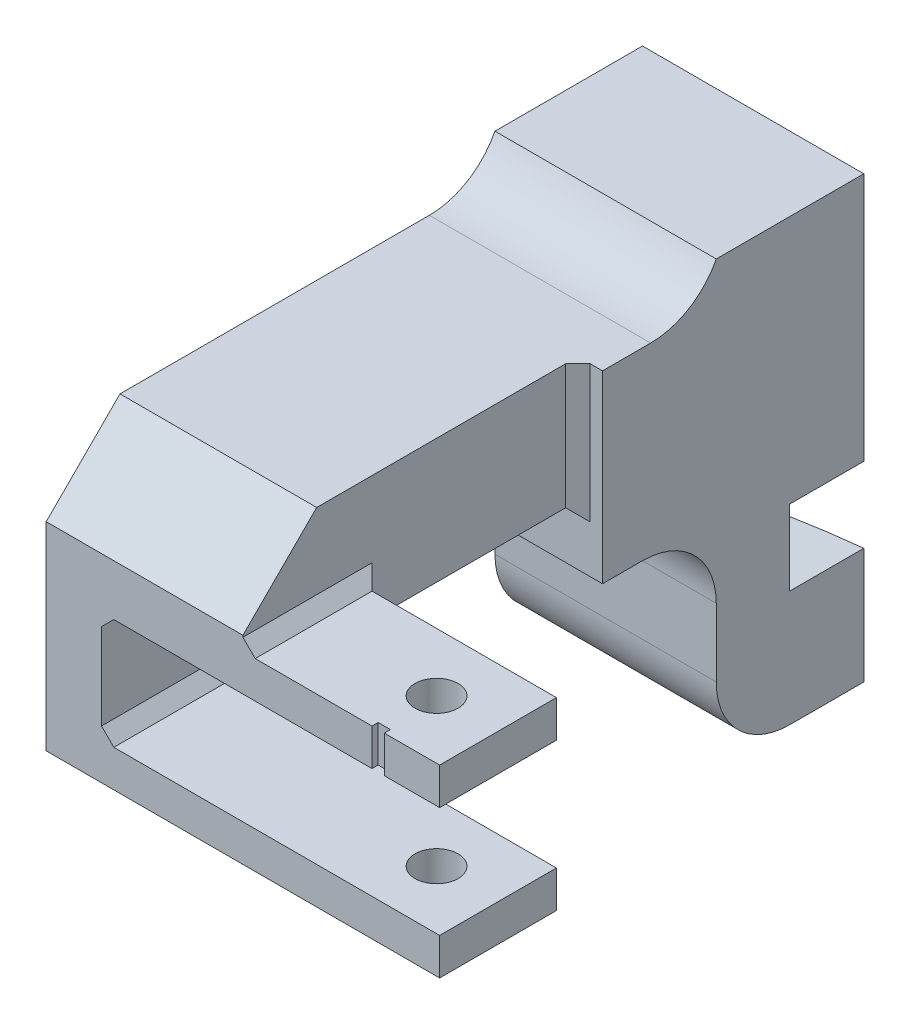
ISO-10303-21;
HEADER;
FILE_DESCRIPTION(('STEP AP214'),'2;1');
FILE_NAME('part.step','',(''),(''),'','','');
FILE_SCHEMA(('AUTOMOTIVE_DESIGN { 1 0 10303 214 1 1 1 1 }'));
ENDSEC;
DATA;
#1=APPLICATION_CONTEXT('core data for automotive mechanical design processes');
#2=APPLICATION_PROTOCOL_DEFINITION('international standard','automotive_design',2000,#1);
#3=PRODUCT_CONTEXT('',#1,'mechanical');
#4=PRODUCT('Part','Part','',(#3));
#5=PRODUCT_RELATED_PRODUCT_CATEGORY('part','',(#4));
#6=PRODUCT_DEFINITION_FORMATION('','',#4);
#7=PRODUCT_DEFINITION_CONTEXT('part definition',#1,'design');
#8=PRODUCT_DEFINITION('design','',#6,#7);
#9=PRODUCT_DEFINITION_SHAPE('','',#8);
#10=(LENGTH_UNIT() NAMED_UNIT(*) SI_UNIT(.MILLI.,.METRE.));
#11=(NAMED_UNIT(*) PLANE_ANGLE_UNIT() SI_UNIT($,.RADIAN.));
#12=(NAMED_UNIT(*) SI_UNIT($,.STERADIAN.) SOLID_ANGLE_UNIT());
#13=UNCERTAINTY_MEASURE_WITH_UNIT(LENGTH_MEASURE(1.E-05),#10,'distance_accuracy_value','');
#14=(GEOMETRIC_REPRESENTATION_CONTEXT(3) GLOBAL_UNCERTAINTY_ASSIGNED_CONTEXT((#13)) GLOBAL_UNIT_ASSIGNED_CONTEXT((#10,
#11,#12)) REPRESENTATION_CONTEXT('',''));
#15=CARTESIAN_POINT('',(0.,0.,0.));
#16=DIRECTION('',(0.,0.,1.));
#17=DIRECTION('',(1.,0.,0.));
#18=AXIS2_PLACEMENT_3D('',#15,#16,#17);
#19=CARTESIAN_POINT('',(0.,0.,48.5));
#20=DIRECTION('',(0.,0.,1.));
#21=DIRECTION('',(1.,0.,0.));
#22=AXIS2_PLACEMENT_3D('',#19,#20,#21);
#23=PLANE('',#22);
#24=DIRECTION('',(0.,-1.,0.));
#25=VECTOR('',#24,1.);
#26=CARTESIAN_POINT('',(17.5,4.5,48.5));
#27=LINE('',#26,#25);
#28=CARTESIAN_POINT('',(17.5,7.5,48.5));
#29=VERTEX_POINT('',#28);
#30=CARTESIAN_POINT('',(17.5,4.5,48.5));
#31=VERTEX_POINT('',#30);
#32=EDGE_CURVE('E688',#29,#31,#27,.T.);
#33=ORIENTED_EDGE('',*,*,#32,.F.);
#34=DIRECTION('',(-1.,0.,0.));
#35=VECTOR('',#34,1.);
#36=CARTESIAN_POINT('',(9.00000000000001,7.5,48.5));
#37=LINE('',#36,#35);
#38=CARTESIAN_POINT('',(8.,7.5,48.5));
#39=VERTEX_POINT('',#38);
#40=EDGE_CURVE('E359',#29,#39,#37,.T.);
#41=ORIENTED_EDGE('',*,*,#40,.T.);
#42=DIRECTION('',(-0.707106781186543,0.707106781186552,0.));
#43=VECTOR('',#42,1.);
#44=CARTESIAN_POINT('',(7.,8.50000000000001,48.5));
#45=LINE('',#44,#43);
#46=CARTESIAN_POINT('',(7.,8.50000000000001,48.5));
#47=VERTEX_POINT('',#46);
#48=EDGE_CURVE('E528',#39,#47,#45,.T.);
#49=ORIENTED_EDGE('',*,*,#48,.T.);
#50=DIRECTION('',(0.,-1.,0.));
#51=VECTOR('',#50,1.);
#52=CARTESIAN_POINT('',(7.,8.64438017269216,48.5));
#53=LINE('',#52,#51);
#54=CARTESIAN_POINT('',(7.,8.64438017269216,48.5));
#55=VERTEX_POINT('',#54);
#56=EDGE_CURVE('E302',#55,#47,#53,.T.);
#57=ORIENTED_EDGE('',*,*,#56,.F.);
#58=DIRECTION('',(-1.,0.,0.));
#59=VECTOR('',#58,1.);
#60=CARTESIAN_POINT('',(0.,8.64438017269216,48.5));
#61=LINE('',#60,#59);
#62=CARTESIAN_POINT('',(-9.00000000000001,8.64438017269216,48.5));
#63=VERTEX_POINT('',#62);
#64=EDGE_CURVE('E478',#55,#63,#61,.T.);
#65=ORIENTED_EDGE('',*,*,#64,.T.);
#66=DIRECTION('',(0.,-1.,0.));
#67=VECTOR('',#66,1.);
#68=CARTESIAN_POINT('',(-9.00000000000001,14.6443801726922,48.5));
#69=LINE('',#68,#67);
#70=CARTESIAN_POINT('',(-8.99999999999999,-7.50000000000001,48.5));
#71=VERTEX_POINT('',#70);
#72=EDGE_CURVE('E365',#63,#71,#69,.T.);
#73=ORIENTED_EDGE('',*,*,#72,.T.);
#74=DIRECTION('',(1.,0.,0.));
#75=VECTOR('',#74,1.);
#76=CARTESIAN_POINT('',(23.,-7.5,48.5));
#77=LINE('',#76,#75);
#78=CARTESIAN_POINT('',(23.,-7.5,48.5));
#79=VERTEX_POINT('',#78);
#80=EDGE_CURVE('E338',#71,#79,#77,.T.);
#81=ORIENTED_EDGE('',*,*,#80,.T.);
#82=DIRECTION('',(0.,1.,0.));
#83=VECTOR('',#82,1.);
#84=CARTESIAN_POINT('',(23.,7.5,48.5));
#85=LINE('',#84,#83);
#86=CARTESIAN_POINT('',(23.,-4.5,48.5));
#87=VERTEX_POINT('',#86);
#88=EDGE_CURVE('E356',#79,#87,#85,.T.);
#89=ORIENTED_EDGE('',*,*,#88,.T.);
#90=DIRECTION('',(1.,0.,0.));
#91=VECTOR('',#90,1.);
#92=CARTESIAN_POINT('',(-4.49999999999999,-4.5,48.5));
#93=LINE('',#92,#91);
#94=CARTESIAN_POINT('',(-3.49999999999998,-4.5,48.5));
#95=VERTEX_POINT('',#94);
#96=EDGE_CURVE('E320',#95,#87,#93,.T.);
#97=ORIENTED_EDGE('',*,*,#96,.F.);
#98=DIRECTION('',(0.707106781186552,-0.707106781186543,0.));
#99=VECTOR('',#98,1.);
#100=CARTESIAN_POINT('',(-3.49999999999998,-4.5,48.5));
#101=LINE('',#100,#99);
#102=CARTESIAN_POINT('',(-4.49999999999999,-3.5,48.5));
#103=VERTEX_POINT('',#102);
#104=EDGE_CURVE('E522',#95,#103,#101,.F.);
#105=ORIENTED_EDGE('',*,*,#104,.T.);
#106=DIRECTION('',(0.,-1.,0.));
#107=VECTOR('',#106,1.);
#108=CARTESIAN_POINT('',(-4.49999999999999,4.5,48.5));
#109=LINE('',#108,#107);
#110=CARTESIAN_POINT('',(-4.49999999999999,3.49999999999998,48.5));
#111=VERTEX_POINT('',#110);
#112=EDGE_CURVE('E322',#111,#103,#109,.T.);
#113=ORIENTED_EDGE('',*,*,#112,.F.);
#114=DIRECTION('',(-0.707106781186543,-0.707106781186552,0.));
#115=VECTOR('',#114,1.);
#116=CARTESIAN_POINT('',(-4.49999999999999,3.49999999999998,48.5));
#117=LINE('',#116,#115);
#118=CARTESIAN_POINT('',(-3.49999999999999,4.5,48.5));
#119=VERTEX_POINT('',#118);
#120=EDGE_CURVE('E530',#111,#119,#117,.F.);
#121=ORIENTED_EDGE('',*,*,#120,.T.);
#122=DIRECTION('',(-1.,0.,0.));
#123=VECTOR('',#122,1.);
#124=CARTESIAN_POINT('',(23.,4.5,48.5));
#125=LINE('',#124,#123);
#126=EDGE_CURVE('E325',#31,#119,#125,.T.);
#127=ORIENTED_EDGE('',*,*,#126,.F.);
#128=EDGE_LOOP('',(#33,#41,#49,#57,#65,#73,#81,#89,#97,#105,#113,#121,#127));
#129=FACE_BOUND('',#128,.T.);
#130=ADVANCED_FACE('F33',(#129),#23,.T.);
#131=CARTESIAN_POINT('',(0.,0.,39.));
#132=DIRECTION('',(0.,0.,-1.));
#133=DIRECTION('',(-1.,0.,0.));
#134=AXIS2_PLACEMENT_3D('',#131,#132,#133);
#135=PLANE('',#134);
#136=DIRECTION('',(0.,-1.,0.));
#137=VECTOR('',#136,1.);
#138=CARTESIAN_POINT('',(-8.99999999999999,-7.50000000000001,39.));
#139=LINE('',#138,#137);
#140=CARTESIAN_POINT('',(-9.,-1.35561982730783,39.));
#141=VERTEX_POINT('',#140);
#142=CARTESIAN_POINT('',(-8.99999999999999,-7.50000000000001,39.));
#143=VERTEX_POINT('',#142);
#144=EDGE_CURVE('E339',#141,#143,#139,.T.);
#145=ORIENTED_EDGE('',*,*,#144,.F.);
#146=DIRECTION('',(1.,0.,0.));
#147=VECTOR('',#146,1.);
#148=CARTESIAN_POINT('',(0.,-1.35561982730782,39.));
#149=LINE('',#148,#147);
#150=CARTESIAN_POINT('',(-4.49999999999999,-1.35561982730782,39.));
#151=VERTEX_POINT('',#150);
#152=EDGE_CURVE('E485',#141,#151,#149,.T.);
#153=ORIENTED_EDGE('',*,*,#152,.T.);
#154=DIRECTION('',(0.,1.,0.));
#155=VECTOR('',#154,1.);
#156=CARTESIAN_POINT('',(-4.49999999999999,0.,39.));
#157=LINE('',#156,#155);
#158=CARTESIAN_POINT('',(-4.49999999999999,-3.5,39.));
#159=VERTEX_POINT('',#158);
#160=EDGE_CURVE('E441',#159,#151,#157,.T.);
#161=ORIENTED_EDGE('',*,*,#160,.F.);
#162=DIRECTION('',(-0.707106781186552,0.707106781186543,0.));
#163=VECTOR('',#162,1.);
#164=CARTESIAN_POINT('',(-3.49999999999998,-4.5,39.));
#165=LINE('',#164,#163);
#166=CARTESIAN_POINT('',(-3.49999999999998,-4.5,39.));
#167=VERTEX_POINT('',#166);
#168=EDGE_CURVE('E524',#159,#167,#165,.F.);
#169=ORIENTED_EDGE('',*,*,#168,.T.);
#170=DIRECTION('',(-1.,0.,0.));
#171=VECTOR('',#170,1.);
#172=CARTESIAN_POINT('',(0.,-4.5,39.));
#173=LINE('',#172,#171);
#174=CARTESIAN_POINT('',(23.,-4.5,39.));
#175=VERTEX_POINT('',#174);
#176=EDGE_CURVE('E329',#175,#167,#173,.T.);
#177=ORIENTED_EDGE('',*,*,#176,.F.);
#178=DIRECTION('',(0.,1.,0.));
#179=VECTOR('',#178,1.);
#180=CARTESIAN_POINT('',(23.,7.5,39.));
#181=LINE('',#180,#179);
#182=CARTESIAN_POINT('',(23.,-7.5,39.));
#183=VERTEX_POINT('',#182);
#184=EDGE_CURVE('E346',#183,#175,#181,.T.);
#185=ORIENTED_EDGE('',*,*,#184,.F.);
#186=DIRECTION('',(1.,0.,0.));
#187=VECTOR('',#186,1.);
#188=CARTESIAN_POINT('',(23.,-7.5,39.));
#189=LINE('',#188,#187);
#190=EDGE_CURVE('E341',#143,#183,#189,.T.);
#191=ORIENTED_EDGE('',*,*,#190,.F.);
#192=EDGE_LOOP('',(#145,#153,#161,#169,#177,#185,#191));
#193=FACE_BOUND('',#192,.T.);
#194=ADVANCED_FACE('F663',(#193),#135,.T.);
#195=CARTESIAN_POINT('',(23.,7.5,39.));
#196=DIRECTION('',(1.,0.,0.));
#197=DIRECTION('',(0.,1.,0.));
#198=AXIS2_PLACEMENT_3D('',#195,#196,#197);
#199=PLANE('',#198);
#200=DIRECTION('',(0.,0.,-1.));
#201=VECTOR('',#200,1.);
#202=CARTESIAN_POINT('',(23.,-4.5,39.));
#203=LINE('',#202,#201);
#204=EDGE_CURVE('E439',#87,#175,#203,.T.);
#205=ORIENTED_EDGE('',*,*,#204,.F.);
#206=ORIENTED_EDGE('',*,*,#88,.F.);
#207=DIRECTION('',(0.,0.,1.));
#208=VECTOR('',#207,1.);
#209=CARTESIAN_POINT('',(23.,-7.5,39.));
#210=LINE('',#209,#208);
#211=EDGE_CURVE('E366',#183,#79,#210,.T.);
#212=ORIENTED_EDGE('',*,*,#211,.F.);
#213=ORIENTED_EDGE('',*,*,#184,.T.);
#214=EDGE_LOOP('',(#205,#206,#212,#213));
#215=FACE_BOUND('',#214,.T.);
#216=ADVANCED_FACE('F671',(#215),#199,.T.);
#217=CARTESIAN_POINT('',(0.,0.,0.));
#218=DIRECTION('',(0.,0.,1.));
#219=DIRECTION('',(1.,0.,0.));
#220=AXIS2_PLACEMENT_3D('',#217,#218,#219);
#221=PLANE('',#220);
#222=CARTESIAN_POINT('',(18.,-102.,0.));
#223=DIRECTION('',(0.,0.,-1.));
#224=DIRECTION('',(-1.,0.,0.));
#225=AXIS2_PLACEMENT_3D('',#222,#223,#224);
#226=CIRCLE('',#225,93.9500000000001);
#227=CARTESIAN_POINT('',(-8.99999999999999,-12.013320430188,0.));
#228=VERTEX_POINT('',#227);
#229=CARTESIAN_POINT('',(9.00000000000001,-8.48207391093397,0.));
#230=VERTEX_POINT('',#229);
#231=EDGE_CURVE('E380',#228,#230,#226,.T.);
#232=ORIENTED_EDGE('',*,*,#231,.T.);
#233=DIRECTION('',(0.,1.,0.));
#234=VECTOR('',#233,1.);
#235=CARTESIAN_POINT('',(9.,17.9,0.));
#236=LINE('',#235,#234);
#237=CARTESIAN_POINT('',(9.00000000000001,-17.9,0.));
#238=VERTEX_POINT('',#237);
#239=EDGE_CURVE('E422',#238,#230,#236,.T.);
#240=ORIENTED_EDGE('',*,*,#239,.F.);
#241=DIRECTION('',(1.,0.,0.));
#242=VECTOR('',#241,1.);
#243=CARTESIAN_POINT('',(-8.99999999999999,-17.9,0.));
#244=LINE('',#243,#242);
#245=CARTESIAN_POINT('',(-8.99999999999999,-17.9,0.));
#246=VERTEX_POINT('',#245);
#247=EDGE_CURVE('E418',#246,#238,#244,.T.);
#248=ORIENTED_EDGE('',*,*,#247,.F.);
#249=DIRECTION('',(0.,-1.,0.));
#250=VECTOR('',#249,1.);
#251=CARTESIAN_POINT('',(-9.,17.9,0.));
#252=LINE('',#251,#250);
#253=EDGE_CURVE('E403',#228,#246,#252,.T.);
#254=ORIENTED_EDGE('',*,*,#253,.F.);
#255=EDGE_LOOP('',(#232,#240,#248,#254));
#256=FACE_BOUND('',#255,.T.);
#257=ADVANCED_FACE('F638',(#256),#221,.F.);
#258=CARTESIAN_POINT('',(-9.,17.9,12.));
#259=DIRECTION('',(1.,0.,0.));
#260=DIRECTION('',(0.,1.,0.));
#261=AXIS2_PLACEMENT_3D('',#258,#259,#260);
#262=PLANE('',#261);
#263=ORIENTED_EDGE('',*,*,#72,.F.);
#264=DIRECTION('',(0.,-0.707106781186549,0.707106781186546));
#265=VECTOR('',#264,1.);
#266=CARTESIAN_POINT('',(-9.,14.6443801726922,42.5));
#267=LINE('',#266,#265);
#268=CARTESIAN_POINT('',(-9.00000000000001,14.6443801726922,42.5));
#269=VERTEX_POINT('',#268);
#270=EDGE_CURVE('E480',#63,#269,#267,.F.);
#271=ORIENTED_EDGE('',*,*,#270,.T.);
#272=DIRECTION('',(0.,0.,-1.));
#273=VECTOR('',#272,1.);
#274=CARTESIAN_POINT('',(-9.00000000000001,14.6443801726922,48.5));
#275=LINE('',#274,#273);
#276=CARTESIAN_POINT('',(-9.00000000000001,14.6443801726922,17.3355765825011));
#277=VERTEX_POINT('',#276);
#278=EDGE_CURVE('E371',#269,#277,#275,.T.);
#279=ORIENTED_EDGE('',*,*,#278,.T.);
#280=CARTESIAN_POINT('',(-9.,20.6443801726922,17.3355765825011));
#281=DIRECTION('',(1.,0.,0.));
#282=DIRECTION('',(0.,1.,0.));
#283=AXIS2_PLACEMENT_3D('',#280,#281,#282);
#284=CIRCLE('',#283,6.);
#285=CARTESIAN_POINT('',(-9.,17.9,12.));
#286=VERTEX_POINT('',#285);
#287=EDGE_CURVE('E468',#277,#286,#284,.T.);
#288=ORIENTED_EDGE('',*,*,#287,.T.);
#289=DIRECTION('',(0.,0.,-1.));
#290=VECTOR('',#289,1.);
#291=CARTESIAN_POINT('',(-9.,17.9,12.));
#292=LINE('',#291,#290);
#293=CARTESIAN_POINT('',(-9.,17.9,0.));
#294=VERTEX_POINT('',#293);
#295=EDGE_CURVE('E414',#286,#294,#292,.T.);
#296=ORIENTED_EDGE('',*,*,#295,.T.);
#297=CARTESIAN_POINT('',(-8.99999999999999,-5.66204019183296,0.));
#298=VERTEX_POINT('',#297);
#299=EDGE_CURVE('E415',#294,#298,#252,.T.);
#300=ORIENTED_EDGE('',*,*,#299,.T.);
#301=DIRECTION('',(0.,0.,-1.));
#302=VECTOR('',#301,1.);
#303=CARTESIAN_POINT('',(-9.,-5.66204019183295,6.05));
#304=LINE('',#303,#302);
#305=CARTESIAN_POINT('',(-9.,-5.66204019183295,6.05));
#306=VERTEX_POINT('',#305);
#307=EDGE_CURVE('E398',#298,#306,#304,.F.);
#308=ORIENTED_EDGE('',*,*,#307,.T.);
#309=DIRECTION('',(0.,1.,0.));
#310=VECTOR('',#309,1.);
#311=CARTESIAN_POINT('',(-9.,17.9,6.05));
#312=LINE('',#311,#310);
#313=CARTESIAN_POINT('',(-9.,-12.013320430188,6.05));
#314=VERTEX_POINT('',#313);
#315=EDGE_CURVE('E401',#314,#306,#312,.T.);
#316=ORIENTED_EDGE('',*,*,#315,.F.);
#317=DIRECTION('',(0.,0.,-1.));
#318=VECTOR('',#317,1.);
#319=CARTESIAN_POINT('',(-9.,-12.013320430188,6.05));
#320=LINE('',#319,#318);
#321=EDGE_CURVE('E393',#228,#314,#320,.F.);
#322=ORIENTED_EDGE('',*,*,#321,.F.);
#323=ORIENTED_EDGE('',*,*,#253,.T.);
#324=DIRECTION('',(0.,0.,-1.));
#325=VECTOR('',#324,1.);
#326=CARTESIAN_POINT('',(-8.99999999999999,-17.9,12.));
#327=LINE('',#326,#325);
#328=CARTESIAN_POINT('',(-8.99999999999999,-17.9,6.));
#329=VERTEX_POINT('',#328);
#330=EDGE_CURVE('E433',#329,#246,#327,.T.);
#331=ORIENTED_EDGE('',*,*,#330,.F.);
#332=CARTESIAN_POINT('',(-8.99999999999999,-11.9,6.));
#333=DIRECTION('',(1.,0.,0.));
#334=DIRECTION('',(0.,1.,0.));
#335=AXIS2_PLACEMENT_3D('',#332,#333,#334);
#336=CIRCLE('',#335,6.);
#337=CARTESIAN_POINT('',(-8.99999999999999,-11.9,12.));
#338=VERTEX_POINT('',#337);
#339=EDGE_CURVE('E463',#329,#338,#336,.F.);
#340=ORIENTED_EDGE('',*,*,#339,.T.);
#341=DIRECTION('',(0.,-1.,0.));
#342=VECTOR('',#341,1.);
#343=CARTESIAN_POINT('',(-9.,17.9,12.));
#344=LINE('',#343,#342);
#345=CARTESIAN_POINT('',(-8.99999999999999,-6.35561982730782,12.));
#346=VERTEX_POINT('',#345);
#347=EDGE_CURVE('E404',#346,#338,#344,.T.);
#348=ORIENTED_EDGE('',*,*,#347,.F.);
#349=CARTESIAN_POINT('',(-8.99999999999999,-6.35561982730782,18.));
#350=DIRECTION('',(1.,0.,0.));
#351=DIRECTION('',(0.,1.,0.));
#352=AXIS2_PLACEMENT_3D('',#349,#350,#351);
#353=CIRCLE('',#352,6.);
#354=CARTESIAN_POINT('',(-9.00000000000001,-0.355619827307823,18.));
#355=VERTEX_POINT('',#354);
#356=EDGE_CURVE('E472',#346,#355,#353,.T.);
#357=ORIENTED_EDGE('',*,*,#356,.T.);
#358=DIRECTION('',(0.,0.,-1.));
#359=VECTOR('',#358,1.);
#360=CARTESIAN_POINT('',(-9.00000000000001,-0.355619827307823,48.5));
#361=LINE('',#360,#359);
#362=CARTESIAN_POINT('',(-9.00000000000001,-0.355619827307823,38.));
#363=VERTEX_POINT('',#362);
#364=EDGE_CURVE('E378',#363,#355,#361,.T.);
#365=ORIENTED_EDGE('',*,*,#364,.F.);
#366=DIRECTION('',(0.,-0.70710678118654,0.707106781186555));
#367=VECTOR('',#366,1.);
#368=CARTESIAN_POINT('',(-9.,21.7721900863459,15.8721900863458));
#369=LINE('',#368,#367);
#370=EDGE_CURVE('E518',#363,#141,#369,.T.);
#371=ORIENTED_EDGE('',*,*,#370,.T.);
#372=ORIENTED_EDGE('',*,*,#144,.T.);
#373=DIRECTION('',(0.,0.,1.));
#374=VECTOR('',#373,1.);
#375=CARTESIAN_POINT('',(-8.99999999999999,-7.50000000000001,39.));
#376=LINE('',#375,#374);
#377=EDGE_CURVE('E352',#143,#71,#376,.T.);
#378=ORIENTED_EDGE('',*,*,#377,.T.);
#379=EDGE_LOOP('',(#263,#271,#279,#288,#296,#300,#308,#316,#322,#323,#331,#340,#348,#357,#365,
#371,#372,#378));
#380=FACE_BOUND('',#379,.T.);
#381=ADVANCED_FACE('F614',(#380),#262,.F.);
#382=CARTESIAN_POINT('',(-8.99999999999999,-17.9,12.));
#383=DIRECTION('',(0.,1.,0.));
#384=DIRECTION('',(-1.,0.,0.));
#385=AXIS2_PLACEMENT_3D('',#382,#383,#384);
#386=PLANE('',#385);
#387=DIRECTION('',(0.,0.,-1.));
#388=VECTOR('',#387,1.);
#389=CARTESIAN_POINT('',(9.00000000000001,-17.9,12.));
#390=LINE('',#389,#388);
#391=CARTESIAN_POINT('',(9.00000000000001,-17.9,6.));
#392=VERTEX_POINT('',#391);
#393=EDGE_CURVE('E431',#392,#238,#390,.T.);
#394=ORIENTED_EDGE('',*,*,#393,.F.);
#395=DIRECTION('',(1.,0.,0.));
#396=VECTOR('',#395,1.);
#397=CARTESIAN_POINT('',(-8.99999999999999,-17.9,6.));
#398=LINE('',#397,#396);
#399=EDGE_CURVE('E461',#392,#329,#398,.F.);
#400=ORIENTED_EDGE('',*,*,#399,.T.);
#401=ORIENTED_EDGE('',*,*,#330,.T.);
#402=ORIENTED_EDGE('',*,*,#247,.T.);
#403=EDGE_LOOP('',(#394,#400,#401,#402));
#404=FACE_BOUND('',#403,.T.);
#405=ADVANCED_FACE('F653',(#404),#386,.F.);
#406=CARTESIAN_POINT('',(9.,17.9,12.));
#407=DIRECTION('',(-1.,0.,0.));
#408=DIRECTION('',(0.,-1.,0.));
#409=AXIS2_PLACEMENT_3D('',#406,#407,#408);
#410=PLANE('',#409);
#411=DIRECTION('',(0.,0.,-1.));
#412=VECTOR('',#411,1.);
#413=CARTESIAN_POINT('',(9.00000000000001,14.6443801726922,48.5));
#414=LINE('',#413,#412);
#415=CARTESIAN_POINT('',(9.,14.6443801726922,21.25));
#416=VERTEX_POINT('',#415);
#417=CARTESIAN_POINT('',(9.00000000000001,14.6443801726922,17.3355765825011));
#418=VERTEX_POINT('',#417);
#419=EDGE_CURVE('E373',#416,#418,#414,.T.);
#420=ORIENTED_EDGE('',*,*,#419,.F.);
#421=DIRECTION('',(0.,1.,0.));
#422=VECTOR('',#421,1.);
#423=CARTESIAN_POINT('',(9.,17.9,21.25));
#424=LINE('',#423,#422);
#425=CARTESIAN_POINT('',(9.,-0.355619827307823,21.25));
#426=VERTEX_POINT('',#425);
#427=EDGE_CURVE('E335',#426,#416,#424,.T.);
#428=ORIENTED_EDGE('',*,*,#427,.F.);
#429=DIRECTION('',(0.,0.,-1.));
#430=VECTOR('',#429,1.);
#431=CARTESIAN_POINT('',(9.00000000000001,-0.355619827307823,48.5));
#432=LINE('',#431,#430);
#433=CARTESIAN_POINT('',(9.00000000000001,-0.355619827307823,18.));
#434=VERTEX_POINT('',#433);
#435=EDGE_CURVE('E375',#426,#434,#432,.T.);
#436=ORIENTED_EDGE('',*,*,#435,.T.);
#437=CARTESIAN_POINT('',(9.,-6.35561982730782,18.));
#438=DIRECTION('',(-1.,0.,0.));
#439=DIRECTION('',(0.,-1.,0.));
#440=AXIS2_PLACEMENT_3D('',#437,#438,#439);
#441=CIRCLE('',#440,6.);
#442=CARTESIAN_POINT('',(9.00000000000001,-6.35561982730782,12.));
#443=VERTEX_POINT('',#442);
#444=EDGE_CURVE('E470',#434,#443,#441,.T.);
#445=ORIENTED_EDGE('',*,*,#444,.T.);
#446=DIRECTION('',(0.,1.,0.));
#447=VECTOR('',#446,1.);
#448=CARTESIAN_POINT('',(9.,17.9,12.));
#449=LINE('',#448,#447);
#450=CARTESIAN_POINT('',(9.00000000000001,-11.9,12.));
#451=VERTEX_POINT('',#450);
#452=EDGE_CURVE('E407',#451,#443,#449,.T.);
#453=ORIENTED_EDGE('',*,*,#452,.F.);
#454=CARTESIAN_POINT('',(9.00000000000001,-11.9,6.));
#455=DIRECTION('',(-1.,0.,0.));
#456=DIRECTION('',(0.,-1.,0.));
#457=AXIS2_PLACEMENT_3D('',#454,#455,#456);
#458=CIRCLE('',#457,6.);
#459=EDGE_CURVE('E459',#451,#392,#458,.F.);
#460=ORIENTED_EDGE('',*,*,#459,.T.);
#461=ORIENTED_EDGE('',*,*,#393,.T.);
#462=ORIENTED_EDGE('',*,*,#239,.T.);
#463=DIRECTION('',(0.,0.,-1.));
#464=VECTOR('',#463,1.);
#465=CARTESIAN_POINT('',(9.00000000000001,-8.48207391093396,6.05));
#466=LINE('',#465,#464);
#467=CARTESIAN_POINT('',(9.00000000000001,-8.48207391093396,6.05));
#468=VERTEX_POINT('',#467);
#469=EDGE_CURVE('E390',#468,#230,#466,.T.);
#470=ORIENTED_EDGE('',*,*,#469,.F.);
#471=DIRECTION('',(0.,-1.,0.));
#472=VECTOR('',#471,1.);
#473=CARTESIAN_POINT('',(9.,17.9,6.05));
#474=LINE('',#473,#472);
#475=CARTESIAN_POINT('',(9.,-2.35561982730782,6.05));
#476=VERTEX_POINT('',#475);
#477=EDGE_CURVE('E435',#476,#468,#474,.T.);
#478=ORIENTED_EDGE('',*,*,#477,.F.);
#479=DIRECTION('',(0.,0.,-1.));
#480=VECTOR('',#479,1.);
#481=CARTESIAN_POINT('',(9.,-2.35561982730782,6.05));
#482=LINE('',#481,#480);
#483=CARTESIAN_POINT('',(9.00000000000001,-2.35561982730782,0.));
#484=VERTEX_POINT('',#483);
#485=EDGE_CURVE('E395',#476,#484,#482,.T.);
#486=ORIENTED_EDGE('',*,*,#485,.T.);
#487=CARTESIAN_POINT('',(9.,17.9,0.));
#488=VERTEX_POINT('',#487);
#489=EDGE_CURVE('E421',#484,#488,#236,.T.);
#490=ORIENTED_EDGE('',*,*,#489,.T.);
#491=DIRECTION('',(0.,0.,-1.));
#492=VECTOR('',#491,1.);
#493=CARTESIAN_POINT('',(9.,17.9,12.));
#494=LINE('',#493,#492);
#495=CARTESIAN_POINT('',(9.,17.9,12.));
#496=VERTEX_POINT('',#495);
#497=EDGE_CURVE('E428',#496,#488,#494,.T.);
#498=ORIENTED_EDGE('',*,*,#497,.F.);
#499=CARTESIAN_POINT('',(9.,20.6443801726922,17.3355765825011));
#500=DIRECTION('',(-1.,0.,0.));
#501=DIRECTION('',(0.,-1.,0.));
#502=AXIS2_PLACEMENT_3D('',#499,#500,#501);
#503=CIRCLE('',#502,6.);
#504=EDGE_CURVE('E465',#496,#418,#503,.T.);
#505=ORIENTED_EDGE('',*,*,#504,.T.);
#506=EDGE_LOOP('',(#420,#428,#436,#445,#453,#460,#461,#462,#470,#478,#486,#490,#498,#505));
#507=FACE_BOUND('',#506,.T.);
#508=ADVANCED_FACE('F604',(#507),#410,.F.);
#509=CARTESIAN_POINT('',(-9.,17.9,12.));
#510=DIRECTION('',(0.,-1.,0.));
#511=DIRECTION('',(1.,0.,0.));
#512=AXIS2_PLACEMENT_3D('',#509,#510,#511);
#513=PLANE('',#512);
#514=DIRECTION('',(-1.,0.,0.));
#515=VECTOR('',#514,1.);
#516=CARTESIAN_POINT('',(-9.,17.9,0.));
#517=LINE('',#516,#515);
#518=EDGE_CURVE('E408',#488,#294,#517,.T.);
#519=ORIENTED_EDGE('',*,*,#518,.T.);
#520=ORIENTED_EDGE('',*,*,#295,.F.);
#521=DIRECTION('',(-1.,0.,0.));
#522=VECTOR('',#521,1.);
#523=CARTESIAN_POINT('',(-9.,17.9,12.));
#524=LINE('',#523,#522);
#525=EDGE_CURVE('E411',#496,#286,#524,.T.);
#526=ORIENTED_EDGE('',*,*,#525,.F.);
#527=ORIENTED_EDGE('',*,*,#497,.T.);
#528=EDGE_LOOP('',(#519,#520,#526,#527));
#529=FACE_BOUND('',#528,.T.);
#530=ADVANCED_FACE('F617',(#529),#513,.F.);
#531=CARTESIAN_POINT('',(0.,0.,12.));
#532=DIRECTION('',(0.,0.,1.));
#533=DIRECTION('',(1.,0.,0.));
#534=AXIS2_PLACEMENT_3D('',#531,#532,#533);
#535=PLANE('',#534);
#536=ORIENTED_EDGE('',*,*,#452,.T.);
#537=DIRECTION('',(1.,0.,0.));
#538=VECTOR('',#537,1.);
#539=CARTESIAN_POINT('',(0.,-6.35561982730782,12.));
#540=LINE('',#539,#538);
#541=EDGE_CURVE('E457',#443,#346,#540,.F.);
#542=ORIENTED_EDGE('',*,*,#541,.T.);
#543=ORIENTED_EDGE('',*,*,#347,.T.);
#544=DIRECTION('',(1.,0.,0.));
#545=VECTOR('',#544,1.);
#546=CARTESIAN_POINT('',(9.00000000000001,-11.9,12.));
#547=LINE('',#546,#545);
#548=EDGE_CURVE('E454',#338,#451,#547,.T.);
#549=ORIENTED_EDGE('',*,*,#548,.T.);
#550=EDGE_LOOP('',(#536,#542,#543,#549));
#551=FACE_BOUND('',#550,.T.);
#552=ADVANCED_FACE('F650',(#551),#535,.T.);
#553=ORIENTED_EDGE('',*,*,#489,.F.);
#554=CARTESIAN_POINT('',(18.,-102.,0.));
#555=DIRECTION('',(0.,0.,-1.));
#556=DIRECTION('',(-1.,0.,0.));
#557=AXIS2_PLACEMENT_3D('',#554,#555,#556);
#558=CIRCLE('',#557,100.05);
#559=EDGE_CURVE('E384',#298,#484,#558,.T.);
#560=ORIENTED_EDGE('',*,*,#559,.F.);
#561=ORIENTED_EDGE('',*,*,#299,.F.);
#562=ORIENTED_EDGE('',*,*,#518,.F.);
#563=EDGE_LOOP('',(#553,#560,#561,#562));
#564=FACE_BOUND('',#563,.T.);
#565=ADVANCED_FACE('F621',(#564),#221,.F.);
#566=CARTESIAN_POINT('',(18.,-102.,6.05));
#567=DIRECTION('',(0.,0.,-1.));
#568=DIRECTION('',(-1.,0.,0.));
#569=AXIS2_PLACEMENT_3D('',#566,#567,#568);
#570=PLANE('',#569);
#571=ORIENTED_EDGE('',*,*,#315,.T.);
#572=CARTESIAN_POINT('',(18.,-102.,6.05));
#573=DIRECTION('',(0.,0.,-1.));
#574=DIRECTION('',(-1.,0.,0.));
#575=AXIS2_PLACEMENT_3D('',#572,#573,#574);
#576=CIRCLE('',#575,100.05);
#577=EDGE_CURVE('E387',#306,#476,#576,.T.);
#578=ORIENTED_EDGE('',*,*,#577,.T.);
#579=ORIENTED_EDGE('',*,*,#477,.T.);
#580=CARTESIAN_POINT('',(18.,-102.,6.05));
#581=DIRECTION('',(0.,0.,-1.));
#582=DIRECTION('',(-1.,0.,0.));
#583=AXIS2_PLACEMENT_3D('',#580,#581,#582);
#584=CIRCLE('',#583,93.9500000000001);
#585=EDGE_CURVE('E381',#314,#468,#584,.T.);
#586=ORIENTED_EDGE('',*,*,#585,.F.);
#587=EDGE_LOOP('',(#571,#578,#579,#586));
#588=FACE_BOUND('',#587,.T.);
#589=ADVANCED_FACE('F630',(#588),#570,.T.);
#590=CARTESIAN_POINT('',(18.,-102.,6.05));
#591=DIRECTION('',(0.,0.,-1.));
#592=DIRECTION('',(-1.,0.,0.));
#593=AXIS2_PLACEMENT_3D('',#590,#591,#592);
#594=CYLINDRICAL_SURFACE('',#593,100.05);
#595=ORIENTED_EDGE('',*,*,#559,.T.);
#596=ORIENTED_EDGE('',*,*,#485,.F.);
#597=ORIENTED_EDGE('',*,*,#577,.F.);
#598=ORIENTED_EDGE('',*,*,#307,.F.);
#599=EDGE_LOOP('',(#595,#596,#597,#598));
#600=FACE_BOUND('',#599,.T.);
#601=ADVANCED_FACE('F627',(#600),#594,.F.);
#602=CARTESIAN_POINT('',(18.,-102.,6.05));
#603=DIRECTION('',(0.,0.,-1.));
#604=DIRECTION('',(-1.,0.,0.));
#605=AXIS2_PLACEMENT_3D('',#602,#603,#604);
#606=CYLINDRICAL_SURFACE('',#605,93.9500000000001);
#607=ORIENTED_EDGE('',*,*,#321,.T.);
#608=ORIENTED_EDGE('',*,*,#585,.T.);
#609=ORIENTED_EDGE('',*,*,#469,.T.);
#610=ORIENTED_EDGE('',*,*,#231,.F.);
#611=EDGE_LOOP('',(#607,#608,#609,#610));
#612=FACE_BOUND('',#611,.T.);
#613=ADVANCED_FACE('F635',(#612),#606,.T.);
#614=CARTESIAN_POINT('',(-9.00000000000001,-0.355619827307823,48.5));
#615=DIRECTION('',(0.,1.,0.));
#616=DIRECTION('',(0.,0.,1.));
#617=AXIS2_PLACEMENT_3D('',#614,#615,#616);
#618=PLANE('',#617);
#619=DIRECTION('',(0.,0.,1.));
#620=VECTOR('',#619,1.);
#621=CARTESIAN_POINT('',(-4.49999999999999,-0.355619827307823,48.5));
#622=LINE('',#621,#620);
#623=CARTESIAN_POINT('',(-4.49999999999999,-0.355619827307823,22.25));
#624=VERTEX_POINT('',#623);
#625=CARTESIAN_POINT('',(-4.49999999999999,-0.355619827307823,38.));
#626=VERTEX_POINT('',#625);
#627=EDGE_CURVE('E332',#624,#626,#622,.T.);
#628=ORIENTED_EDGE('',*,*,#627,.T.);
#629=DIRECTION('',(-1.,0.,0.));
#630=VECTOR('',#629,1.);
#631=CARTESIAN_POINT('',(-9.00000000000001,-0.355619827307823,38.));
#632=LINE('',#631,#630);
#633=EDGE_CURVE('E482',#626,#363,#632,.T.);
#634=ORIENTED_EDGE('',*,*,#633,.T.);
#635=ORIENTED_EDGE('',*,*,#364,.T.);
#636=DIRECTION('',(1.,0.,0.));
#637=VECTOR('',#636,1.);
#638=CARTESIAN_POINT('',(-9.00000000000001,-0.355619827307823,18.));
#639=LINE('',#638,#637);
#640=EDGE_CURVE('E451',#355,#434,#639,.T.);
#641=ORIENTED_EDGE('',*,*,#640,.T.);
#642=ORIENTED_EDGE('',*,*,#435,.F.);
#643=DIRECTION('',(1.,0.,0.));
#644=VECTOR('',#643,1.);
#645=CARTESIAN_POINT('',(-9.00000000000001,-0.355619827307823,21.25));
#646=LINE('',#645,#644);
#647=CARTESIAN_POINT('',(-3.49999999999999,-0.355619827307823,21.25));
#648=VERTEX_POINT('',#647);
#649=EDGE_CURVE('E444',#648,#426,#646,.T.);
#650=ORIENTED_EDGE('',*,*,#649,.F.);
#651=DIRECTION('',(-0.707106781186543,0.,0.707106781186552));
#652=VECTOR('',#651,1.);
#653=CARTESIAN_POINT('',(-19.875,-0.355619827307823,37.6250000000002));
#654=LINE('',#653,#652);
#655=EDGE_CURVE('E42',#648,#624,#654,.T.);
#656=ORIENTED_EDGE('',*,*,#655,.T.);
#657=EDGE_LOOP('',(#628,#634,#635,#641,#642,#650,#656));
#658=FACE_BOUND('',#657,.T.);
#659=ADVANCED_FACE('F599',(#658),#618,.F.);
#660=CARTESIAN_POINT('',(-9.00000000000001,14.6443801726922,48.5));
#661=DIRECTION('',(0.,1.,0.));
#662=DIRECTION('',(0.,0.,1.));
#663=AXIS2_PLACEMENT_3D('',#660,#661,#662);
#664=PLANE('',#663);
#665=DIRECTION('',(0.,0.,1.));
#666=VECTOR('',#665,1.);
#667=CARTESIAN_POINT('',(7.,14.6443801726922,21.25));
#668=LINE('',#667,#666);
#669=CARTESIAN_POINT('',(7.,14.6443801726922,22.25));
#670=VERTEX_POINT('',#669);
#671=CARTESIAN_POINT('',(7.,14.6443801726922,42.5));
#672=VERTEX_POINT('',#671);
#673=EDGE_CURVE('E297',#670,#672,#668,.T.);
#674=ORIENTED_EDGE('',*,*,#673,.F.);
#675=DIRECTION('',(0.707106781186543,0.,-0.707106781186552));
#676=VECTOR('',#675,1.);
#677=CARTESIAN_POINT('',(7.,14.6443801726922,22.25));
#678=LINE('',#677,#676);
#679=CARTESIAN_POINT('',(8.,14.6443801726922,21.25));
#680=VERTEX_POINT('',#679);
#681=EDGE_CURVE('E11',#670,#680,#678,.T.);
#682=ORIENTED_EDGE('',*,*,#681,.T.);
#683=DIRECTION('',(1.,0.,0.));
#684=VECTOR('',#683,1.);
#685=CARTESIAN_POINT('',(7.,14.6443801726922,21.25));
#686=LINE('',#685,#684);
#687=EDGE_CURVE('E305',#680,#416,#686,.T.);
#688=ORIENTED_EDGE('',*,*,#687,.T.);
#689=ORIENTED_EDGE('',*,*,#419,.T.);
#690=DIRECTION('',(-1.,0.,0.));
#691=VECTOR('',#690,1.);
#692=CARTESIAN_POINT('',(-9.,14.6443801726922,17.3355765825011));
#693=LINE('',#692,#691);
#694=EDGE_CURVE('E446',#418,#277,#693,.T.);
#695=ORIENTED_EDGE('',*,*,#694,.T.);
#696=ORIENTED_EDGE('',*,*,#278,.F.);
#697=DIRECTION('',(1.,0.,0.));
#698=VECTOR('',#697,1.);
#699=CARTESIAN_POINT('',(-9.00000000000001,14.6443801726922,42.5));
#700=LINE('',#699,#698);
#701=EDGE_CURVE('E475',#269,#672,#700,.T.);
#702=ORIENTED_EDGE('',*,*,#701,.T.);
#703=EDGE_LOOP('',(#674,#682,#688,#689,#695,#696,#702));
#704=FACE_BOUND('',#703,.T.);
#705=ADVANCED_FACE('F561',(#704),#664,.T.);
#706=DIRECTION('',(0.,1.,0.));
#707=VECTOR('',#706,1.);
#708=CARTESIAN_POINT('',(18.5,4.5,48.5));
#709=LINE('',#708,#707);
#710=CARTESIAN_POINT('',(18.5,4.5,48.5));
#711=VERTEX_POINT('',#710);
#712=CARTESIAN_POINT('',(18.5,7.5,48.5));
#713=VERTEX_POINT('',#712);
#714=EDGE_CURVE('E685',#711,#713,#709,.T.);
#715=ORIENTED_EDGE('',*,*,#714,.F.);
#716=CARTESIAN_POINT('',(23.,4.5,48.5));
#717=VERTEX_POINT('',#716);
#718=EDGE_CURVE('E289',#717,#711,#125,.T.);
#719=ORIENTED_EDGE('',*,*,#718,.F.);
#720=CARTESIAN_POINT('',(23.,7.5,48.5));
#721=VERTEX_POINT('',#720);
#722=EDGE_CURVE('E355',#717,#721,#85,.T.);
#723=ORIENTED_EDGE('',*,*,#722,.T.);
#724=EDGE_CURVE('E342',#721,#713,#37,.T.);
#725=ORIENTED_EDGE('',*,*,#724,.T.);
#726=EDGE_LOOP('',(#715,#719,#723,#725));
#727=FACE_BOUND('',#726,.T.);
#728=ADVANCED_FACE('F665',(#727),#23,.T.);
#729=DIRECTION('',(1.,0.,0.));
#730=VECTOR('',#729,1.);
#731=CARTESIAN_POINT('',(0.,4.5,39.));
#732=LINE('',#731,#730);
#733=CARTESIAN_POINT('',(8.,4.5,39.));
#734=VERTEX_POINT('',#733);
#735=CARTESIAN_POINT('',(23.,4.5,39.));
#736=VERTEX_POINT('',#735);
#737=EDGE_CURVE('E327',#734,#736,#732,.T.);
#738=ORIENTED_EDGE('',*,*,#737,.F.);
#739=DIRECTION('',(0.,1.,0.));
#740=VECTOR('',#739,1.);
#741=CARTESIAN_POINT('',(8.,0.,39.));
#742=LINE('',#741,#740);
#743=CARTESIAN_POINT('',(8.,7.5,39.));
#744=VERTEX_POINT('',#743);
#745=EDGE_CURVE('E504',#734,#744,#742,.T.);
#746=ORIENTED_EDGE('',*,*,#745,.T.);
#747=DIRECTION('',(-1.,0.,0.));
#748=VECTOR('',#747,1.);
#749=CARTESIAN_POINT('',(9.00000000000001,7.5,39.));
#750=LINE('',#749,#748);
#751=CARTESIAN_POINT('',(23.,7.5,39.));
#752=VERTEX_POINT('',#751);
#753=EDGE_CURVE('E349',#752,#744,#750,.T.);
#754=ORIENTED_EDGE('',*,*,#753,.F.);
#755=EDGE_CURVE('E345',#736,#752,#181,.T.);
#756=ORIENTED_EDGE('',*,*,#755,.F.);
#757=EDGE_LOOP('',(#738,#746,#754,#756));
#758=FACE_BOUND('',#757,.T.);
#759=ADVANCED_FACE('F674',(#758),#135,.T.);
#760=CARTESIAN_POINT('',(9.00000000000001,7.5,39.));
#761=DIRECTION('',(0.,1.,0.));
#762=DIRECTION('',(0.,0.,1.));
#763=AXIS2_PLACEMENT_3D('',#760,#761,#762);
#764=PLANE('',#763);
#765=DIRECTION('',(0.,0.,1.));
#766=VECTOR('',#765,1.);
#767=CARTESIAN_POINT('',(17.5,7.5,48.));
#768=LINE('',#767,#766);
#769=CARTESIAN_POINT('',(17.5,7.5,48.));
#770=VERTEX_POINT('',#769);
#771=EDGE_CURVE('E292',#770,#29,#768,.T.);
#772=ORIENTED_EDGE('',*,*,#771,.F.);
#773=DIRECTION('',(-1.,0.,0.));
#774=VECTOR('',#773,1.);
#775=CARTESIAN_POINT('',(18.5,7.5,48.));
#776=LINE('',#775,#774);
#777=CARTESIAN_POINT('',(18.5,7.5,48.));
#778=VERTEX_POINT('',#777);
#779=EDGE_CURVE('E278',#778,#770,#776,.T.);
#780=ORIENTED_EDGE('',*,*,#779,.F.);
#781=DIRECTION('',(0.,0.,1.));
#782=VECTOR('',#781,1.);
#783=CARTESIAN_POINT('',(18.5,7.5,48.));
#784=LINE('',#783,#782);
#785=EDGE_CURVE('E276',#778,#713,#784,.T.);
#786=ORIENTED_EDGE('',*,*,#785,.T.);
#787=ORIENTED_EDGE('',*,*,#724,.F.);
#788=DIRECTION('',(0.,0.,1.));
#789=VECTOR('',#788,1.);
#790=CARTESIAN_POINT('',(23.,7.5,39.));
#791=LINE('',#790,#789);
#792=EDGE_CURVE('E362',#752,#721,#791,.T.);
#793=ORIENTED_EDGE('',*,*,#792,.F.);
#794=ORIENTED_EDGE('',*,*,#753,.T.);
#795=DIRECTION('',(0.,0.,1.));
#796=VECTOR('',#795,1.);
#797=CARTESIAN_POINT('',(8.,7.5,39.));
#798=LINE('',#797,#796);
#799=EDGE_CURVE('E506',#744,#39,#798,.T.);
#800=ORIENTED_EDGE('',*,*,#799,.T.);
#801=ORIENTED_EDGE('',*,*,#40,.F.);
#802=EDGE_LOOP('',(#772,#780,#786,#787,#793,#794,#800,#801));
#803=FACE_BOUND('',#802,.T.);
#804=CARTESIAN_POINT('',(18.,7.5,43.75));
#805=DIRECTION('',(0.,1.,0.));
#806=DIRECTION('',(0.,0.,1.));
#807=AXIS2_PLACEMENT_3D('',#804,#805,#806);
#808=CIRCLE('',#807,1.75);
#809=CARTESIAN_POINT('',(18.,7.5,45.5));
#810=VERTEX_POINT('',#809);
#811=EDGE_CURVE('E317',#810,#810,#808,.T.);
#812=ORIENTED_EDGE('',*,*,#811,.F.);
#813=EDGE_LOOP('',(#812));
#814=FACE_BOUND('',#813,.T.);
#815=ADVANCED_FACE('F682',(#803,#814),#764,.T.);
#816=DIRECTION('',(0.,0.,1.));
#817=VECTOR('',#816,1.);
#818=CARTESIAN_POINT('',(23.,4.5,39.));
#819=LINE('',#818,#817);
#820=EDGE_CURVE('E437',#736,#717,#819,.T.);
#821=ORIENTED_EDGE('',*,*,#820,.F.);
#822=ORIENTED_EDGE('',*,*,#755,.T.);
#823=ORIENTED_EDGE('',*,*,#792,.T.);
#824=ORIENTED_EDGE('',*,*,#722,.F.);
#825=EDGE_LOOP('',(#821,#822,#823,#824));
#826=FACE_BOUND('',#825,.T.);
#827=ADVANCED_FACE('F792',(#826),#199,.T.);
#828=CARTESIAN_POINT('',(23.,-7.5,39.));
#829=DIRECTION('',(0.,-1.,0.));
#830=DIRECTION('',(1.,0.,0.));
#831=AXIS2_PLACEMENT_3D('',#828,#829,#830);
#832=PLANE('',#831);
#833=CARTESIAN_POINT('',(18.,-7.5,43.75));
#834=DIRECTION('',(0.,-1.,0.));
#835=DIRECTION('',(1.,0.,0.));
#836=AXIS2_PLACEMENT_3D('',#833,#834,#835);
#837=CIRCLE('',#836,1.75);
#838=CARTESIAN_POINT('',(19.75,-7.5,43.75));
#839=VERTEX_POINT('',#838);
#840=EDGE_CURVE('E310',#839,#839,#837,.T.);
#841=ORIENTED_EDGE('',*,*,#840,.F.);
#842=EDGE_LOOP('',(#841));
#843=FACE_BOUND('',#842,.T.);
#844=ORIENTED_EDGE('',*,*,#80,.F.);
#845=ORIENTED_EDGE('',*,*,#377,.F.);
#846=ORIENTED_EDGE('',*,*,#190,.T.);
#847=ORIENTED_EDGE('',*,*,#211,.T.);
#848=EDGE_LOOP('',(#844,#845,#846,#847));
#849=FACE_BOUND('',#848,.T.);
#850=ADVANCED_FACE('F781',(#843,#849),#832,.T.);
#851=CARTESIAN_POINT('',(0.,0.,21.25));
#852=DIRECTION('',(0.,0.,1.));
#853=DIRECTION('',(1.,0.,0.));
#854=AXIS2_PLACEMENT_3D('',#851,#852,#853);
#855=PLANE('',#854);
#856=DIRECTION('',(-1.,0.,0.));
#857=VECTOR('',#856,1.);
#858=CARTESIAN_POINT('',(0.,3.5,21.25));
#859=LINE('',#858,#857);
#860=CARTESIAN_POINT('',(8.,3.5,21.25));
#861=VERTEX_POINT('',#860);
#862=CARTESIAN_POINT('',(-3.49999999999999,3.5,21.25));
#863=VERTEX_POINT('',#862);
#864=EDGE_CURVE('E58',#861,#863,#859,.T.);
#865=ORIENTED_EDGE('',*,*,#864,.T.);
#866=DIRECTION('',(0.,-1.,0.));
#867=VECTOR('',#866,1.);
#868=CARTESIAN_POINT('',(-3.49999999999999,0.,21.25));
#869=LINE('',#868,#867);
#870=EDGE_CURVE('E516',#863,#648,#869,.T.);
#871=ORIENTED_EDGE('',*,*,#870,.T.);
#872=ORIENTED_EDGE('',*,*,#649,.T.);
#873=ORIENTED_EDGE('',*,*,#427,.T.);
#874=ORIENTED_EDGE('',*,*,#687,.F.);
#875=DIRECTION('',(0.,-1.,0.));
#876=VECTOR('',#875,1.);
#877=CARTESIAN_POINT('',(8.,0.,21.25));
#878=LINE('',#877,#876);
#879=EDGE_CURVE('E513',#680,#861,#878,.T.);
#880=ORIENTED_EDGE('',*,*,#879,.T.);
#881=EDGE_LOOP('',(#865,#871,#872,#873,#874,#880));
#882=FACE_BOUND('',#881,.T.);
#883=ADVANCED_FACE('F595',(#882),#855,.T.);
#884=CARTESIAN_POINT('',(-4.49999999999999,4.5,21.25));
#885=DIRECTION('',(-1.,0.,0.));
#886=DIRECTION('',(0.,0.,1.));
#887=AXIS2_PLACEMENT_3D('',#884,#885,#886);
#888=PLANE('',#887);
#889=ORIENTED_EDGE('',*,*,#112,.T.);
#890=DIRECTION('',(0.,0.,-1.));
#891=VECTOR('',#890,1.);
#892=CARTESIAN_POINT('',(-4.49999999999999,-3.5,39.));
#893=LINE('',#892,#891);
#894=EDGE_CURVE('E495',#103,#159,#893,.T.);
#895=ORIENTED_EDGE('',*,*,#894,.T.);
#896=ORIENTED_EDGE('',*,*,#160,.T.);
#897=DIRECTION('',(0.,0.70710678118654,-0.707106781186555));
#898=VECTOR('',#897,1.);
#899=CARTESIAN_POINT('',(-4.49999999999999,10.447190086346,27.1971900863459));
#900=LINE('',#899,#898);
#901=EDGE_CURVE('E520',#151,#626,#900,.T.);
#902=ORIENTED_EDGE('',*,*,#901,.T.);
#903=ORIENTED_EDGE('',*,*,#627,.F.);
#904=DIRECTION('',(0.,1.,0.));
#905=VECTOR('',#904,1.);
#906=CARTESIAN_POINT('',(-4.49999999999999,4.5,22.25));
#907=LINE('',#906,#905);
#908=CARTESIAN_POINT('',(-4.49999999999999,3.49999999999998,22.25));
#909=VERTEX_POINT('',#908);
#910=EDGE_CURVE('E490',#624,#909,#907,.T.);
#911=ORIENTED_EDGE('',*,*,#910,.T.);
#912=DIRECTION('',(0.,0.,1.));
#913=VECTOR('',#912,1.);
#914=CARTESIAN_POINT('',(-4.49999999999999,3.49999999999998,48.5));
#915=LINE('',#914,#913);
#916=EDGE_CURVE('E492',#909,#111,#915,.T.);
#917=ORIENTED_EDGE('',*,*,#916,.T.);
#918=EDGE_LOOP('',(#889,#895,#896,#902,#903,#911,#917));
#919=FACE_BOUND('',#918,.T.);
#920=ADVANCED_FACE('F780',(#919),#888,.F.);
#921=CARTESIAN_POINT('',(23.,4.5,21.25));
#922=DIRECTION('',(0.,1.,0.));
#923=DIRECTION('',(-1.,0.,0.));
#924=AXIS2_PLACEMENT_3D('',#921,#922,#923);
#925=PLANE('',#924);
#926=CARTESIAN_POINT('',(18.,4.5,43.75));
#927=DIRECTION('',(0.,1.,0.));
#928=DIRECTION('',(-1.,0.,0.));
#929=AXIS2_PLACEMENT_3D('',#926,#927,#928);
#930=CIRCLE('',#929,1.75);
#931=CARTESIAN_POINT('',(16.25,4.5,43.75));
#932=VERTEX_POINT('',#931);
#933=EDGE_CURVE('E314',#932,#932,#930,.T.);
#934=ORIENTED_EDGE('',*,*,#933,.T.);
#935=EDGE_LOOP('',(#934));
#936=FACE_BOUND('',#935,.T.);
#937=DIRECTION('',(1.,0.,0.));
#938=VECTOR('',#937,1.);
#939=CARTESIAN_POINT('',(18.5,4.5,48.));
#940=LINE('',#939,#938);
#941=CARTESIAN_POINT('',(17.5,4.5,48.));
#942=VERTEX_POINT('',#941);
#943=CARTESIAN_POINT('',(18.5,4.5,48.));
#944=VERTEX_POINT('',#943);
#945=EDGE_CURVE('E279',#942,#944,#940,.T.);
#946=ORIENTED_EDGE('',*,*,#945,.F.);
#947=DIRECTION('',(0.,0.,1.));
#948=VECTOR('',#947,1.);
#949=CARTESIAN_POINT('',(17.5,4.5,48.));
#950=LINE('',#949,#948);
#951=EDGE_CURVE('E290',#942,#31,#950,.T.);
#952=ORIENTED_EDGE('',*,*,#951,.T.);
#953=ORIENTED_EDGE('',*,*,#126,.T.);
#954=DIRECTION('',(0.,0.,-1.));
#955=VECTOR('',#954,1.);
#956=CARTESIAN_POINT('',(-3.49999999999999,4.5,21.25));
#957=LINE('',#956,#955);
#958=CARTESIAN_POINT('',(-3.49999999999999,4.5,22.25));
#959=VERTEX_POINT('',#958);
#960=EDGE_CURVE('E511',#119,#959,#957,.T.);
#961=ORIENTED_EDGE('',*,*,#960,.T.);
#962=DIRECTION('',(1.,0.,0.));
#963=VECTOR('',#962,1.);
#964=CARTESIAN_POINT('',(23.,4.5,22.25));
#965=LINE('',#964,#963);
#966=CARTESIAN_POINT('',(7.,4.5,22.25));
#967=VERTEX_POINT('',#966);
#968=EDGE_CURVE('E509',#959,#967,#965,.T.);
#969=ORIENTED_EDGE('',*,*,#968,.T.);
#970=DIRECTION('',(0.,0.,1.));
#971=VECTOR('',#970,1.);
#972=CARTESIAN_POINT('',(7.,4.5,21.25));
#973=LINE('',#972,#971);
#974=CARTESIAN_POINT('',(7.,4.5,38.));
#975=VERTEX_POINT('',#974);
#976=EDGE_CURVE('E307',#967,#975,#973,.T.);
#977=ORIENTED_EDGE('',*,*,#976,.T.);
#978=DIRECTION('',(0.707106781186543,0.,0.707106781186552));
#979=VECTOR('',#978,1.);
#980=CARTESIAN_POINT('',(6.6249999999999,4.5,37.6249999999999));
#981=LINE('',#980,#979);
#982=EDGE_CURVE('E526',#975,#734,#981,.T.);
#983=ORIENTED_EDGE('',*,*,#982,.T.);
#984=ORIENTED_EDGE('',*,*,#737,.T.);
#985=ORIENTED_EDGE('',*,*,#820,.T.);
#986=ORIENTED_EDGE('',*,*,#718,.T.);
#987=DIRECTION('',(0.,0.,1.));
#988=VECTOR('',#987,1.);
#989=CARTESIAN_POINT('',(18.5,4.5,48.));
#990=LINE('',#989,#988);
#991=EDGE_CURVE('E273',#944,#711,#990,.T.);
#992=ORIENTED_EDGE('',*,*,#991,.F.);
#993=EDGE_LOOP('',(#946,#952,#953,#961,#969,#977,#983,#984,#985,#986,#992));
#994=FACE_BOUND('',#993,.T.);
#995=ADVANCED_FACE('F287',(#936,#994),#925,.F.);
#996=CARTESIAN_POINT('',(-4.49999999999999,-4.5,21.25));
#997=DIRECTION('',(0.,-1.,0.));
#998=DIRECTION('',(0.,0.,-1.));
#999=AXIS2_PLACEMENT_3D('',#996,#997,#998);
#1000=PLANE('',#999);
#1001=CARTESIAN_POINT('',(18.,-4.5,43.75));
#1002=DIRECTION('',(0.,-1.,0.));
#1003=DIRECTION('',(0.,0.,-1.));
#1004=AXIS2_PLACEMENT_3D('',#1001,#1002,#1003);
#1005=CIRCLE('',#1004,1.75);
#1006=CARTESIAN_POINT('',(18.,-4.5,42.));
#1007=VERTEX_POINT('',#1006);
#1008=EDGE_CURVE('E313',#1007,#1007,#1005,.T.);
#1009=ORIENTED_EDGE('',*,*,#1008,.T.);
#1010=EDGE_LOOP('',(#1009));
#1011=FACE_BOUND('',#1010,.T.);
#1012=ORIENTED_EDGE('',*,*,#176,.T.);
#1013=DIRECTION('',(0.,0.,1.));
#1014=VECTOR('',#1013,1.);
#1015=CARTESIAN_POINT('',(-3.49999999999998,-4.5,48.5));
#1016=LINE('',#1015,#1014);
#1017=EDGE_CURVE('E487',#167,#95,#1016,.T.);
#1018=ORIENTED_EDGE('',*,*,#1017,.T.);
#1019=ORIENTED_EDGE('',*,*,#96,.T.);
#1020=ORIENTED_EDGE('',*,*,#204,.T.);
#1021=EDGE_LOOP('',(#1012,#1018,#1019,#1020));
#1022=FACE_BOUND('',#1021,.T.);
#1023=ADVANCED_FACE('F783',(#1011,#1022),#1000,.F.);
#1024=CARTESIAN_POINT('',(18.,17.9,43.75));
#1025=DIRECTION('',(0.,-1.,0.));
#1026=DIRECTION('',(1.,0.,0.));
#1027=AXIS2_PLACEMENT_3D('',#1024,#1025,#1026);
#1028=CYLINDRICAL_SURFACE('',#1027,1.75);
#1029=ORIENTED_EDGE('',*,*,#840,.T.);
#1030=EDGE_LOOP('',(#1029));
#1031=FACE_BOUND('',#1030,.T.);
#1032=ORIENTED_EDGE('',*,*,#1008,.F.);
#1033=EDGE_LOOP('',(#1032));
#1034=FACE_BOUND('',#1033,.T.);
#1035=ADVANCED_FACE('F776',(#1031,#1034),#1028,.F.);
#1036=ORIENTED_EDGE('',*,*,#811,.T.);
#1037=EDGE_LOOP('',(#1036));
#1038=FACE_BOUND('',#1037,.T.);
#1039=ORIENTED_EDGE('',*,*,#933,.F.);
#1040=EDGE_LOOP('',(#1039));
#1041=FACE_BOUND('',#1040,.T.);
#1042=ADVANCED_FACE('F773',(#1038,#1041),#1028,.F.);
#1043=CARTESIAN_POINT('',(0.,20.6443801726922,17.3355765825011));
#1044=DIRECTION('',(1.,0.,0.));
#1045=DIRECTION('',(0.,1.,0.));
#1046=AXIS2_PLACEMENT_3D('',#1043,#1044,#1045);
#1047=CYLINDRICAL_SURFACE('',#1046,6.);
#1048=ORIENTED_EDGE('',*,*,#287,.F.);
#1049=ORIENTED_EDGE('',*,*,#694,.F.);
#1050=ORIENTED_EDGE('',*,*,#504,.F.);
#1051=ORIENTED_EDGE('',*,*,#525,.T.);
#1052=EDGE_LOOP('',(#1048,#1049,#1050,#1051));
#1053=FACE_BOUND('',#1052,.T.);
#1054=ADVANCED_FACE('F611',(#1053),#1047,.F.);
#1055=CARTESIAN_POINT('',(-9.00000000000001,-6.35561982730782,18.));
#1056=DIRECTION('',(1.,0.,0.));
#1057=DIRECTION('',(0.,0.,-1.));
#1058=AXIS2_PLACEMENT_3D('',#1055,#1056,#1057);
#1059=CYLINDRICAL_SURFACE('',#1058,6.);
#1060=ORIENTED_EDGE('',*,*,#356,.F.);
#1061=ORIENTED_EDGE('',*,*,#541,.F.);
#1062=ORIENTED_EDGE('',*,*,#444,.F.);
#1063=ORIENTED_EDGE('',*,*,#640,.F.);
#1064=EDGE_LOOP('',(#1060,#1061,#1062,#1063));
#1065=FACE_BOUND('',#1064,.T.);
#1066=ADVANCED_FACE('F816',(#1065),#1059,.F.);
#1067=CARTESIAN_POINT('',(0.,-11.9,6.));
#1068=DIRECTION('',(-1.,0.,0.));
#1069=DIRECTION('',(0.,-1.,0.));
#1070=AXIS2_PLACEMENT_3D('',#1067,#1068,#1069);
#1071=CYLINDRICAL_SURFACE('',#1070,6.);
#1072=ORIENTED_EDGE('',*,*,#339,.F.);
#1073=ORIENTED_EDGE('',*,*,#399,.F.);
#1074=ORIENTED_EDGE('',*,*,#459,.F.);
#1075=ORIENTED_EDGE('',*,*,#548,.F.);
#1076=EDGE_LOOP('',(#1072,#1073,#1074,#1075));
#1077=FACE_BOUND('',#1076,.T.);
#1078=ADVANCED_FACE('F648',(#1077),#1071,.T.);
#1079=CARTESIAN_POINT('',(-9.00000000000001,14.6443801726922,42.5));
#1080=DIRECTION('',(0.,-0.707106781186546,-0.707106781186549));
#1081=DIRECTION('',(1.,0.,0.));
#1082=AXIS2_PLACEMENT_3D('',#1079,#1080,#1081);
#1083=PLANE('',#1082);
#1084=DIRECTION('',(0.,-0.707106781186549,0.707106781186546));
#1085=VECTOR('',#1084,1.);
#1086=CARTESIAN_POINT('',(7.,14.6443801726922,42.5));
#1087=LINE('',#1086,#1085);
#1088=EDGE_CURVE('E299',#672,#55,#1087,.T.);
#1089=ORIENTED_EDGE('',*,*,#1088,.F.);
#1090=ORIENTED_EDGE('',*,*,#701,.F.);
#1091=ORIENTED_EDGE('',*,*,#270,.F.);
#1092=ORIENTED_EDGE('',*,*,#64,.F.);
#1093=EDGE_LOOP('',(#1089,#1090,#1091,#1092));
#1094=FACE_BOUND('',#1093,.T.);
#1095=ADVANCED_FACE('F567',(#1094),#1083,.F.);
#1096=CARTESIAN_POINT('',(7.,0.,0.));
#1097=DIRECTION('',(-1.,0.,0.));
#1098=DIRECTION('',(0.,-1.,0.));
#1099=AXIS2_PLACEMENT_3D('',#1096,#1097,#1098);
#1100=PLANE('',#1099);
#1101=DIRECTION('',(0.,0.,-1.));
#1102=VECTOR('',#1101,1.);
#1103=CARTESIAN_POINT('',(7.,8.50000000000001,0.));
#1104=LINE('',#1103,#1102);
#1105=CARTESIAN_POINT('',(7.,8.50000000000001,38.));
#1106=VERTEX_POINT('',#1105);
#1107=EDGE_CURVE('E499',#47,#1106,#1104,.T.);
#1108=ORIENTED_EDGE('',*,*,#1107,.T.);
#1109=DIRECTION('',(0.,-1.,0.));
#1110=VECTOR('',#1109,1.);
#1111=CARTESIAN_POINT('',(7.,0.,38.));
#1112=LINE('',#1111,#1110);
#1113=EDGE_CURVE('E501',#1106,#975,#1112,.T.);
#1114=ORIENTED_EDGE('',*,*,#1113,.T.);
#1115=ORIENTED_EDGE('',*,*,#976,.F.);
#1116=DIRECTION('',(0.,1.,0.));
#1117=VECTOR('',#1116,1.);
#1118=CARTESIAN_POINT('',(7.,0.,22.25));
#1119=LINE('',#1118,#1117);
#1120=EDGE_CURVE('E497',#967,#670,#1119,.T.);
#1121=ORIENTED_EDGE('',*,*,#1120,.T.);
#1122=ORIENTED_EDGE('',*,*,#673,.T.);
#1123=ORIENTED_EDGE('',*,*,#1088,.T.);
#1124=ORIENTED_EDGE('',*,*,#56,.T.);
#1125=EDGE_LOOP('',(#1108,#1114,#1115,#1121,#1122,#1123,#1124));
#1126=FACE_BOUND('',#1125,.T.);
#1127=ADVANCED_FACE('F558',(#1126),#1100,.F.);
#1128=CARTESIAN_POINT('',(-9.00000000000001,-0.355619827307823,38.));
#1129=DIRECTION('',(0.,0.707106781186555,0.70710678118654));
#1130=DIRECTION('',(-1.,0.,0.));
#1131=AXIS2_PLACEMENT_3D('',#1128,#1129,#1130);
#1132=PLANE('',#1131);
#1133=ORIENTED_EDGE('',*,*,#901,.F.);
#1134=ORIENTED_EDGE('',*,*,#152,.F.);
#1135=ORIENTED_EDGE('',*,*,#370,.F.);
#1136=ORIENTED_EDGE('',*,*,#633,.F.);
#1137=EDGE_LOOP('',(#1133,#1134,#1135,#1136));
#1138=FACE_BOUND('',#1137,.T.);
#1139=ADVANCED_FACE('F772',(#1138),#1132,.F.);
#1140=CARTESIAN_POINT('',(-3.49999999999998,-4.5,21.25));
#1141=DIRECTION('',(0.707106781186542,0.707106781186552,0.));
#1142=DIRECTION('',(0.,0.,-1.));
#1143=AXIS2_PLACEMENT_3D('',#1140,#1141,#1142);
#1144=PLANE('',#1143);
#1145=ORIENTED_EDGE('',*,*,#168,.F.);
#1146=ORIENTED_EDGE('',*,*,#894,.F.);
#1147=ORIENTED_EDGE('',*,*,#104,.F.);
#1148=ORIENTED_EDGE('',*,*,#1017,.F.);
#1149=EDGE_LOOP('',(#1145,#1146,#1147,#1148));
#1150=FACE_BOUND('',#1149,.T.);
#1151=ADVANCED_FACE('F709',(#1150),#1144,.T.);
#1152=CARTESIAN_POINT('',(7.,8.50000000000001,0.));
#1153=DIRECTION('',(-0.707106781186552,-0.707106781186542,0.));
#1154=DIRECTION('',(0.,0.,-1.));
#1155=AXIS2_PLACEMENT_3D('',#1152,#1153,#1154);
#1156=PLANE('',#1155);
#1157=ORIENTED_EDGE('',*,*,#48,.F.);
#1158=ORIENTED_EDGE('',*,*,#799,.F.);
#1159=DIRECTION('',(-0.57735026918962,0.577350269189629,-0.577350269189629));
#1160=VECTOR('',#1159,1.);
#1161=CARTESIAN_POINT('',(-5.6666666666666,21.1666666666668,25.3333333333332));
#1162=LINE('',#1161,#1160);
#1163=EDGE_CURVE('E300',#1106,#744,#1162,.F.);
#1164=ORIENTED_EDGE('',*,*,#1163,.F.);
#1165=ORIENTED_EDGE('',*,*,#1107,.F.);
#1166=EDGE_LOOP('',(#1157,#1158,#1164,#1165));
#1167=FACE_BOUND('',#1166,.T.);
#1168=ADVANCED_FACE('F578',(#1167),#1156,.F.);
#1169=CARTESIAN_POINT('',(7.,0.,38.));
#1170=DIRECTION('',(-0.707106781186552,0.,0.707106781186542));
#1171=DIRECTION('',(0.,-1.,0.));
#1172=AXIS2_PLACEMENT_3D('',#1169,#1170,#1171);
#1173=PLANE('',#1172);
#1174=ORIENTED_EDGE('',*,*,#1163,.T.);
#1175=ORIENTED_EDGE('',*,*,#745,.F.);
#1176=ORIENTED_EDGE('',*,*,#982,.F.);
#1177=ORIENTED_EDGE('',*,*,#1113,.F.);
#1178=EDGE_LOOP('',(#1174,#1175,#1176,#1177));
#1179=FACE_BOUND('',#1178,.T.);
#1180=ADVANCED_FACE('F702',(#1179),#1173,.F.);
#1181=CARTESIAN_POINT('',(7.,0.,22.25));
#1182=DIRECTION('',(-0.707106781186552,0.,-0.707106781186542));
#1183=DIRECTION('',(0.,1.,0.));
#1184=AXIS2_PLACEMENT_3D('',#1181,#1182,#1183);
#1185=PLANE('',#1184);
#1186=ORIENTED_EDGE('',*,*,#681,.F.);
#1187=ORIENTED_EDGE('',*,*,#1120,.F.);
#1188=DIRECTION('',(0.577350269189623,-0.577350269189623,-0.577350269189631));
#1189=VECTOR('',#1188,1.);
#1190=CARTESIAN_POINT('',(8.49999999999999,3.00000000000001,20.75));
#1191=LINE('',#1190,#1189);
#1192=EDGE_CURVE('E37',#861,#967,#1191,.F.);
#1193=ORIENTED_EDGE('',*,*,#1192,.F.);
#1194=ORIENTED_EDGE('',*,*,#879,.F.);
#1195=EDGE_LOOP('',(#1186,#1187,#1193,#1194));
#1196=FACE_BOUND('',#1195,.T.);
#1197=ADVANCED_FACE('F35',(#1196),#1185,.F.);
#1198=CARTESIAN_POINT('',(0.,3.5,21.25));
#1199=DIRECTION('',(0.,0.707106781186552,-0.707106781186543));
#1200=DIRECTION('',(-1.,0.,0.));
#1201=AXIS2_PLACEMENT_3D('',#1198,#1199,#1200);
#1202=PLANE('',#1201);
#1203=ORIENTED_EDGE('',*,*,#1192,.T.);
#1204=ORIENTED_EDGE('',*,*,#968,.F.);
#1205=DIRECTION('',(0.,0.707106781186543,0.707106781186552));
#1206=VECTOR('',#1205,1.);
#1207=CARTESIAN_POINT('',(-3.49999999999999,4.5,22.25));
#1208=LINE('',#1207,#1206);
#1209=EDGE_CURVE('E541',#863,#959,#1208,.T.);
#1210=ORIENTED_EDGE('',*,*,#1209,.F.);
#1211=ORIENTED_EDGE('',*,*,#864,.F.);
#1212=EDGE_LOOP('',(#1203,#1204,#1210,#1211));
#1213=FACE_BOUND('',#1212,.T.);
#1214=ADVANCED_FACE('F550',(#1213),#1202,.F.);
#1215=CARTESIAN_POINT('',(-3.49999999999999,0.,21.25));
#1216=DIRECTION('',(-0.707106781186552,0.,-0.707106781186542));
#1217=DIRECTION('',(0.,-1.,0.));
#1218=AXIS2_PLACEMENT_3D('',#1215,#1216,#1217);
#1219=PLANE('',#1218);
#1220=ORIENTED_EDGE('',*,*,#655,.F.);
#1221=ORIENTED_EDGE('',*,*,#870,.F.);
#1222=DIRECTION('',(0.707106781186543,0.,-0.707106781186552));
#1223=VECTOR('',#1222,1.);
#1224=CARTESIAN_POINT('',(-3.99999999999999,3.49999999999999,21.75));
#1225=LINE('',#1224,#1223);
#1226=EDGE_CURVE('E539',#909,#863,#1225,.T.);
#1227=ORIENTED_EDGE('',*,*,#1226,.F.);
#1228=ORIENTED_EDGE('',*,*,#910,.F.);
#1229=EDGE_LOOP('',(#1220,#1221,#1227,#1228));
#1230=FACE_BOUND('',#1229,.T.);
#1231=ADVANCED_FACE('F593',(#1230),#1219,.F.);
#1232=CARTESIAN_POINT('',(-3.49999999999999,4.5,22.25));
#1233=DIRECTION('',(0.577350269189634,-0.577350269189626,0.577350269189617));
#1234=DIRECTION('',(0.707106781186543,0.707106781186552,0.));
#1235=AXIS2_PLACEMENT_3D('',#1232,#1233,#1234);
#1236=PLANE('',#1235);
#1237=ORIENTED_EDGE('',*,*,#1226,.T.);
#1238=ORIENTED_EDGE('',*,*,#1209,.T.);
#1239=DIRECTION('',(0.707106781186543,0.707106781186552,0.));
#1240=VECTOR('',#1239,1.);
#1241=CARTESIAN_POINT('',(-3.49999999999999,4.5,22.25));
#1242=LINE('',#1241,#1240);
#1243=EDGE_CURVE('E536',#909,#959,#1242,.T.);
#1244=ORIENTED_EDGE('',*,*,#1243,.F.);
#1245=EDGE_LOOP('',(#1237,#1238,#1244));
#1246=FACE_BOUND('',#1245,.T.);
#1247=ADVANCED_FACE('F588',(#1246),#1236,.T.);
#1248=CARTESIAN_POINT('',(-4.49999999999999,3.49999999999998,21.25));
#1249=DIRECTION('',(0.707106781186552,-0.707106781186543,0.));
#1250=DIRECTION('',(0.,0.,-1.));
#1251=AXIS2_PLACEMENT_3D('',#1248,#1249,#1250);
#1252=PLANE('',#1251);
#1253=ORIENTED_EDGE('',*,*,#1243,.T.);
#1254=ORIENTED_EDGE('',*,*,#960,.F.);
#1255=ORIENTED_EDGE('',*,*,#120,.F.);
#1256=ORIENTED_EDGE('',*,*,#916,.F.);
#1257=EDGE_LOOP('',(#1253,#1254,#1255,#1256));
#1258=FACE_BOUND('',#1257,.T.);
#1259=ADVANCED_FACE('F586',(#1258),#1252,.T.);
#1260=CARTESIAN_POINT('',(17.5,4.5,48.));
#1261=DIRECTION('',(-1.,0.,0.));
#1262=DIRECTION('',(0.,0.,1.));
#1263=AXIS2_PLACEMENT_3D('',#1260,#1261,#1262);
#1264=PLANE('',#1263);
#1265=ORIENTED_EDGE('',*,*,#32,.T.);
#1266=ORIENTED_EDGE('',*,*,#951,.F.);
#1267=DIRECTION('',(0.,-1.,0.));
#1268=VECTOR('',#1267,1.);
#1269=CARTESIAN_POINT('',(17.5,4.5,48.));
#1270=LINE('',#1269,#1268);
#1271=EDGE_CURVE('E50',#770,#942,#1270,.T.);
#1272=ORIENTED_EDGE('',*,*,#1271,.F.);
#1273=ORIENTED_EDGE('',*,*,#771,.T.);
#1274=EDGE_LOOP('',(#1265,#1266,#1272,#1273));
#1275=FACE_BOUND('',#1274,.T.);
#1276=ADVANCED_FACE('F695',(#1275),#1264,.F.);
#1277=CARTESIAN_POINT('',(18.5,4.5,48.));
#1278=DIRECTION('',(1.,0.,0.));
#1279=DIRECTION('',(0.,0.,-1.));
#1280=AXIS2_PLACEMENT_3D('',#1277,#1278,#1279);
#1281=PLANE('',#1280);
#1282=ORIENTED_EDGE('',*,*,#714,.T.);
#1283=ORIENTED_EDGE('',*,*,#785,.F.);
#1284=DIRECTION('',(0.,1.,0.));
#1285=VECTOR('',#1284,1.);
#1286=CARTESIAN_POINT('',(18.5,4.5,48.));
#1287=LINE('',#1286,#1285);
#1288=EDGE_CURVE('E270',#944,#778,#1287,.T.);
#1289=ORIENTED_EDGE('',*,*,#1288,.F.);
#1290=ORIENTED_EDGE('',*,*,#991,.T.);
#1291=EDGE_LOOP('',(#1282,#1283,#1289,#1290));
#1292=FACE_BOUND('',#1291,.T.);
#1293=ADVANCED_FACE('F271',(#1292),#1281,.F.);
#1294=CARTESIAN_POINT('',(0.,0.,48.));
#1295=DIRECTION('',(0.,0.,1.));
#1296=DIRECTION('',(1.,0.,0.));
#1297=AXIS2_PLACEMENT_3D('',#1294,#1295,#1296);
#1298=PLANE('',#1297);
#1299=ORIENTED_EDGE('',*,*,#1271,.T.);
#1300=ORIENTED_EDGE('',*,*,#945,.T.);
#1301=ORIENTED_EDGE('',*,*,#1288,.T.);
#1302=ORIENTED_EDGE('',*,*,#779,.T.);
#1303=EDGE_LOOP('',(#1299,#1300,#1301,#1302));
#1304=FACE_BOUND('',#1303,.T.);
#1305=ADVANCED_FACE('F282',(#1304),#1298,.T.);
#1306=CLOSED_SHELL('',(#130,#194,#216,#257,#381,#405,#508,#530,#552,#565,#589,#601,#613,#659,
#705,#728,#759,#815,#827,#850,#883,#920,#995,#1023,#1035,#1042,#1054,#1066,#1078,#1095,#1127,
#1139,#1151,#1168,#1180,#1197,#1214,#1231,#1247,#1259,#1276,#1293,#1305));
#1307=MANIFOLD_SOLID_BREP('B2',#1306);
#1308=ADVANCED_BREP_SHAPE_REPRESENTATION('',(#18,#1307),#14);
#1309=SHAPE_DEFINITION_REPRESENTATION(#9,#1308);
ENDSEC;
END-ISO-10303-21;
